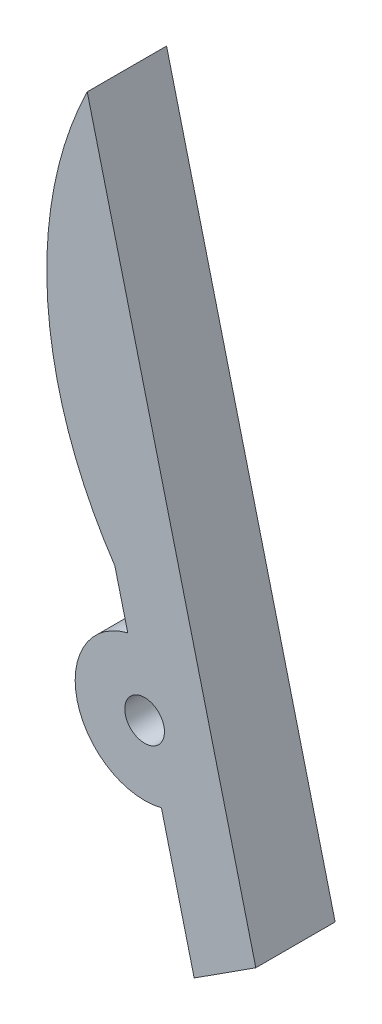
ISO-10303-21;
HEADER;
FILE_DESCRIPTION(('STEP AP214'),'2;1');
FILE_NAME('part.step','',(''),(''),'','','');
FILE_SCHEMA(('AUTOMOTIVE_DESIGN { 1 0 10303 214 1 1 1 1 }'));
ENDSEC;
DATA;
#1=APPLICATION_CONTEXT('core data for automotive mechanical design processes');
#2=APPLICATION_PROTOCOL_DEFINITION('international standard','automotive_design',2000,#1);
#3=PRODUCT_CONTEXT('',#1,'mechanical');
#4=PRODUCT('Part','Part','',(#3));
#5=PRODUCT_RELATED_PRODUCT_CATEGORY('part','',(#4));
#6=PRODUCT_DEFINITION_FORMATION('','',#4);
#7=PRODUCT_DEFINITION_CONTEXT('part definition',#1,'design');
#8=PRODUCT_DEFINITION('design','',#6,#7);
#9=PRODUCT_DEFINITION_SHAPE('','',#8);
#10=(LENGTH_UNIT() NAMED_UNIT(*) SI_UNIT(.MILLI.,.METRE.));
#11=(NAMED_UNIT(*) PLANE_ANGLE_UNIT() SI_UNIT($,.RADIAN.));
#12=(NAMED_UNIT(*) SI_UNIT($,.STERADIAN.) SOLID_ANGLE_UNIT());
#13=UNCERTAINTY_MEASURE_WITH_UNIT(LENGTH_MEASURE(1.E-05),#10,'distance_accuracy_value','');
#14=(GEOMETRIC_REPRESENTATION_CONTEXT(3) GLOBAL_UNCERTAINTY_ASSIGNED_CONTEXT((#13)) GLOBAL_UNIT_ASSIGNED_CONTEXT((#10,
#11,#12)) REPRESENTATION_CONTEXT('',''));
#15=CARTESIAN_POINT('',(0.,0.,0.));
#16=DIRECTION('',(0.,0.,1.));
#17=DIRECTION('',(1.,0.,0.));
#18=AXIS2_PLACEMENT_3D('',#15,#16,#17);
#19=CARTESIAN_POINT('',(4.5,33.,41.5109748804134));
#20=DIRECTION('',(0.970142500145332,0.242535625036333,0.));
#21=DIRECTION('',(-0.242535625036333,0.970142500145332,0.));
#22=AXIS2_PLACEMENT_3D('',#19,#20,#21);
#23=PLANE('',#22);
#24=DIRECTION('',(0.242535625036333,-0.970142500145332,0.));
#25=VECTOR('',#24,1.);
#26=CARTESIAN_POINT('',(4.5,33.,4.));
#27=LINE('',#26,#25);
#28=CARTESIAN_POINT('',(2.84887468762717,39.6045012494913,4.));
#29=VERTEX_POINT('',#28);
#30=CARTESIAN_POINT('',(4.5,33.,4.));
#31=VERTEX_POINT('',#30);
#32=EDGE_CURVE('E87',#29,#31,#27,.T.);
#33=ORIENTED_EDGE('',*,*,#32,.F.);
#34=DIRECTION('',(0.,0.,-1.));
#35=VECTOR('',#34,1.);
#36=CARTESIAN_POINT('',(2.84887468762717,39.6045012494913,41.5109748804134));
#37=LINE('',#36,#35);
#38=CARTESIAN_POINT('',(2.84887468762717,39.6045012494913,0.));
#39=VERTEX_POINT('',#38);
#40=EDGE_CURVE('E47',#29,#39,#37,.T.);
#41=ORIENTED_EDGE('',*,*,#40,.T.);
#42=DIRECTION('',(0.242535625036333,-0.970142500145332,0.));
#43=VECTOR('',#42,1.);
#44=CARTESIAN_POINT('',(4.5,33.,0.));
#45=LINE('',#44,#43);
#46=CARTESIAN_POINT('',(4.5,33.,0.));
#47=VERTEX_POINT('',#46);
#48=EDGE_CURVE('E90',#39,#47,#45,.T.);
#49=ORIENTED_EDGE('',*,*,#48,.T.);
#50=DIRECTION('',(0.,0.,-1.));
#51=VECTOR('',#50,1.);
#52=CARTESIAN_POINT('',(4.5,33.,41.5109748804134));
#53=LINE('',#52,#51);
#54=EDGE_CURVE('E84',#31,#47,#53,.T.);
#55=ORIENTED_EDGE('',*,*,#54,.F.);
#56=EDGE_LOOP('',(#33,#41,#49,#55));
#57=FACE_BOUND('',#56,.T.);
#58=ADVANCED_FACE('F31',(#57),#23,.F.);
#59=CARTESIAN_POINT('',(2.,43.,41.5109748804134));
#60=DIRECTION('',(0.,0.,-1.));
#61=DIRECTION('',(-1.,0.,0.));
#62=AXIS2_PLACEMENT_3D('',#59,#60,#61);
#63=CYLINDRICAL_SURFACE('',#62,3.5);
#64=CARTESIAN_POINT('',(2.,43.,4.));
#65=DIRECTION('',(0.,0.,1.));
#66=DIRECTION('',(1.,0.,0.));
#67=AXIS2_PLACEMENT_3D('',#64,#65,#66);
#68=CIRCLE('',#67,3.5);
#69=CARTESIAN_POINT('',(1.15112531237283,46.3954987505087,4.));
#70=VERTEX_POINT('',#69);
#71=EDGE_CURVE('E102',#70,#29,#68,.T.);
#72=ORIENTED_EDGE('',*,*,#71,.F.);
#73=DIRECTION('',(0.,0.,-1.));
#74=VECTOR('',#73,1.);
#75=CARTESIAN_POINT('',(1.15112531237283,46.3954987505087,41.5109748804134));
#76=LINE('',#75,#74);
#77=CARTESIAN_POINT('',(1.15112531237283,46.3954987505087,0.));
#78=VERTEX_POINT('',#77);
#79=EDGE_CURVE('E130',#70,#78,#76,.T.);
#80=ORIENTED_EDGE('',*,*,#79,.T.);
#81=CARTESIAN_POINT('',(2.,43.,0.));
#82=DIRECTION('',(0.,0.,1.));
#83=DIRECTION('',(1.,0.,0.));
#84=AXIS2_PLACEMENT_3D('',#81,#82,#83);
#85=CIRCLE('',#84,3.5);
#86=EDGE_CURVE('E126',#78,#39,#85,.T.);
#87=ORIENTED_EDGE('',*,*,#86,.T.);
#88=ORIENTED_EDGE('',*,*,#40,.F.);
#89=EDGE_LOOP('',(#72,#80,#87,#88));
#90=FACE_BOUND('',#89,.T.);
#91=ADVANCED_FACE('F148',(#90),#63,.T.);
#92=CARTESIAN_POINT('',(1.15112531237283,46.3954987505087,41.5109748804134));
#93=DIRECTION('',(0.970142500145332,0.242535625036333,0.));
#94=DIRECTION('',(-0.242535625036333,0.970142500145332,0.));
#95=AXIS2_PLACEMENT_3D('',#92,#93,#94);
#96=PLANE('',#95);
#97=DIRECTION('',(0.242535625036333,-0.970142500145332,0.));
#98=VECTOR('',#97,1.);
#99=CARTESIAN_POINT('',(1.15112531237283,46.3954987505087,4.));
#100=LINE('',#99,#98);
#101=CARTESIAN_POINT('',(0.499999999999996,49.,4.));
#102=VERTEX_POINT('',#101);
#103=EDGE_CURVE('E104',#102,#70,#100,.T.);
#104=ORIENTED_EDGE('',*,*,#103,.F.);
#105=DIRECTION('',(0.,0.,-1.));
#106=VECTOR('',#105,1.);
#107=CARTESIAN_POINT('',(0.499999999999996,49.,41.5109748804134));
#108=LINE('',#107,#106);
#109=CARTESIAN_POINT('',(0.499999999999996,49.,0.));
#110=VERTEX_POINT('',#109);
#111=EDGE_CURVE('E132',#102,#110,#108,.T.);
#112=ORIENTED_EDGE('',*,*,#111,.T.);
#113=DIRECTION('',(0.242535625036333,-0.970142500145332,0.));
#114=VECTOR('',#113,1.);
#115=CARTESIAN_POINT('',(1.15112531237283,46.3954987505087,0.));
#116=LINE('',#115,#114);
#117=EDGE_CURVE('E123',#110,#78,#116,.T.);
#118=ORIENTED_EDGE('',*,*,#117,.T.);
#119=ORIENTED_EDGE('',*,*,#79,.F.);
#120=EDGE_LOOP('',(#104,#112,#118,#119));
#121=FACE_BOUND('',#120,.T.);
#122=ADVANCED_FACE('F147',(#121),#96,.F.);
#123=CARTESIAN_POINT('',(17.0685885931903,60.2018691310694,41.5109748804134));
#124=DIRECTION('',(0.,0.,-1.));
#125=DIRECTION('',(-1.,0.,0.));
#126=AXIS2_PLACEMENT_3D('',#123,#124,#125);
#127=CYLINDRICAL_SURFACE('',#126,20.);
#128=CARTESIAN_POINT('',(17.0685885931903,60.2018691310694,4.));
#129=DIRECTION('',(0.,0.,1.));
#130=DIRECTION('',(1.,0.,0.));
#131=AXIS2_PLACEMENT_3D('',#128,#129,#130);
#132=CIRCLE('',#131,20.);
#133=CARTESIAN_POINT('',(-0.892282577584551,69.,4.));
#134=VERTEX_POINT('',#133);
#135=EDGE_CURVE('E109',#134,#102,#132,.T.);
#136=ORIENTED_EDGE('',*,*,#135,.F.);
#137=DIRECTION('',(0.,0.,-1.));
#138=VECTOR('',#137,1.);
#139=CARTESIAN_POINT('',(-0.892282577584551,69.,41.5109748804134));
#140=LINE('',#139,#138);
#141=CARTESIAN_POINT('',(-0.892282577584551,69.,0.));
#142=VERTEX_POINT('',#141);
#143=EDGE_CURVE('E40',#134,#142,#140,.T.);
#144=ORIENTED_EDGE('',*,*,#143,.T.);
#145=CARTESIAN_POINT('',(17.0685885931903,60.2018691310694,0.));
#146=DIRECTION('',(0.,0.,1.));
#147=DIRECTION('',(-1.,0.,0.));
#148=AXIS2_PLACEMENT_3D('',#145,#146,#147);
#149=CIRCLE('',#148,20.);
#150=EDGE_CURVE('E120',#142,#110,#149,.T.);
#151=ORIENTED_EDGE('',*,*,#150,.T.);
#152=ORIENTED_EDGE('',*,*,#111,.F.);
#153=EDGE_LOOP('',(#136,#144,#151,#152));
#154=FACE_BOUND('',#153,.T.);
#155=ADVANCED_FACE('F135',(#154),#127,.T.);
#156=CARTESIAN_POINT('',(-0.892282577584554,69.,41.5109748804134));
#157=DIRECTION('',(-0.970142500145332,-0.242535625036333,0.));
#158=DIRECTION('',(0.242535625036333,-0.970142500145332,0.));
#159=AXIS2_PLACEMENT_3D('',#156,#157,#158);
#160=PLANE('',#159);
#161=DIRECTION('',(-0.242535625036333,0.970142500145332,0.));
#162=VECTOR('',#161,1.);
#163=CARTESIAN_POINT('',(-0.892282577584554,69.,4.));
#164=LINE('',#163,#162);
#165=CARTESIAN_POINT('',(7.60771742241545,35.,4.));
#166=VERTEX_POINT('',#165);
#167=EDGE_CURVE('E54',#166,#134,#164,.T.);
#168=ORIENTED_EDGE('',*,*,#167,.F.);
#169=DIRECTION('',(0.,0.,-1.));
#170=VECTOR('',#169,1.);
#171=CARTESIAN_POINT('',(7.60771742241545,35.,41.5109748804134));
#172=LINE('',#171,#170);
#173=CARTESIAN_POINT('',(7.60771742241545,35.,0.));
#174=VERTEX_POINT('',#173);
#175=EDGE_CURVE('E11',#166,#174,#172,.T.);
#176=ORIENTED_EDGE('',*,*,#175,.T.);
#177=DIRECTION('',(-0.242535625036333,0.970142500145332,0.));
#178=VECTOR('',#177,1.);
#179=CARTESIAN_POINT('',(-0.892282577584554,69.,0.));
#180=LINE('',#179,#178);
#181=EDGE_CURVE('E117',#174,#142,#180,.T.);
#182=ORIENTED_EDGE('',*,*,#181,.T.);
#183=ORIENTED_EDGE('',*,*,#143,.F.);
#184=EDGE_LOOP('',(#168,#176,#182,#183));
#185=FACE_BOUND('',#184,.T.);
#186=ADVANCED_FACE('F140',(#185),#160,.F.);
#187=CARTESIAN_POINT('',(7.60771742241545,35.,41.5109748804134));
#188=DIRECTION('',(-0.541175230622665,0.840909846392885,0.));
#189=DIRECTION('',(-0.840909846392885,-0.541175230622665,0.));
#190=AXIS2_PLACEMENT_3D('',#187,#188,#189);
#191=PLANE('',#190);
#192=DIRECTION('',(0.840909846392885,0.541175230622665,0.));
#193=VECTOR('',#192,1.);
#194=CARTESIAN_POINT('',(7.60771742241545,35.,4.));
#195=LINE('',#194,#193);
#196=EDGE_CURVE('E96',#31,#166,#195,.T.);
#197=ORIENTED_EDGE('',*,*,#196,.F.);
#198=ORIENTED_EDGE('',*,*,#54,.T.);
#199=DIRECTION('',(0.840909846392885,0.541175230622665,0.));
#200=VECTOR('',#199,1.);
#201=CARTESIAN_POINT('',(7.60771742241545,35.,0.));
#202=LINE('',#201,#200);
#203=EDGE_CURVE('E115',#47,#174,#202,.T.);
#204=ORIENTED_EDGE('',*,*,#203,.T.);
#205=ORIENTED_EDGE('',*,*,#175,.F.);
#206=EDGE_LOOP('',(#197,#198,#204,#205));
#207=FACE_BOUND('',#206,.T.);
#208=ADVANCED_FACE('F33',(#207),#191,.F.);
#209=CARTESIAN_POINT('',(2.,43.,0.));
#210=DIRECTION('',(0.,0.,1.));
#211=DIRECTION('',(1.,0.,0.));
#212=AXIS2_PLACEMENT_3D('',#209,#210,#211);
#213=PLANE('',#212);
#214=ORIENTED_EDGE('',*,*,#203,.F.);
#215=ORIENTED_EDGE('',*,*,#48,.F.);
#216=ORIENTED_EDGE('',*,*,#86,.F.);
#217=ORIENTED_EDGE('',*,*,#117,.F.);
#218=ORIENTED_EDGE('',*,*,#150,.F.);
#219=ORIENTED_EDGE('',*,*,#181,.F.);
#220=EDGE_LOOP('',(#214,#215,#216,#217,#218,#219));
#221=FACE_BOUND('',#220,.T.);
#222=CARTESIAN_POINT('',(2.,43.,0.));
#223=DIRECTION('',(0.,0.,1.));
#224=DIRECTION('',(1.,0.,0.));
#225=AXIS2_PLACEMENT_3D('',#222,#223,#224);
#226=CIRCLE('',#225,1.);
#227=CARTESIAN_POINT('',(3.,43.,0.));
#228=VERTEX_POINT('',#227);
#229=EDGE_CURVE('E98',#228,#228,#226,.T.);
#230=ORIENTED_EDGE('',*,*,#229,.T.);
#231=EDGE_LOOP('',(#230));
#232=FACE_BOUND('',#231,.T.);
#233=ADVANCED_FACE('F142',(#221,#232),#213,.F.);
#234=CARTESIAN_POINT('',(2.,43.,41.5109748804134));
#235=DIRECTION('',(0.,0.,-1.));
#236=DIRECTION('',(-1.,0.,0.));
#237=AXIS2_PLACEMENT_3D('',#234,#235,#236);
#238=CYLINDRICAL_SURFACE('',#237,1.);
#239=ORIENTED_EDGE('',*,*,#229,.F.);
#240=EDGE_LOOP('',(#239));
#241=FACE_BOUND('',#240,.T.);
#242=CARTESIAN_POINT('',(2.,43.,4.));
#243=DIRECTION('',(0.,0.,1.));
#244=DIRECTION('',(1.,0.,0.));
#245=AXIS2_PLACEMENT_3D('',#242,#243,#244);
#246=CIRCLE('',#245,1.);
#247=CARTESIAN_POINT('',(3.,43.,4.));
#248=VERTEX_POINT('',#247);
#249=EDGE_CURVE('E35',#248,#248,#246,.T.);
#250=ORIENTED_EDGE('',*,*,#249,.T.);
#251=EDGE_LOOP('',(#250));
#252=FACE_BOUND('',#251,.T.);
#253=ADVANCED_FACE('F167',(#241,#252),#238,.F.);
#254=CARTESIAN_POINT('',(-1.,30.5,4.));
#255=DIRECTION('',(0.,0.,1.));
#256=DIRECTION('',(1.,0.,0.));
#257=AXIS2_PLACEMENT_3D('',#254,#255,#256);
#258=PLANE('',#257);
#259=ORIENTED_EDGE('',*,*,#249,.F.);
#260=EDGE_LOOP('',(#259));
#261=FACE_BOUND('',#260,.T.);
#262=ORIENTED_EDGE('',*,*,#32,.T.);
#263=ORIENTED_EDGE('',*,*,#196,.T.);
#264=ORIENTED_EDGE('',*,*,#167,.T.);
#265=ORIENTED_EDGE('',*,*,#135,.T.);
#266=ORIENTED_EDGE('',*,*,#103,.T.);
#267=ORIENTED_EDGE('',*,*,#71,.T.);
#268=EDGE_LOOP('',(#262,#263,#264,#265,#266,#267));
#269=FACE_BOUND('',#268,.T.);
#270=ADVANCED_FACE('F100',(#261,#269),#258,.T.);
#271=CLOSED_SHELL('',(#58,#91,#122,#155,#186,#208,#233,#253,#270));
#272=MANIFOLD_SOLID_BREP('B2',#271);
#273=ADVANCED_BREP_SHAPE_REPRESENTATION('',(#18,#272),#14);
#274=SHAPE_DEFINITION_REPRESENTATION(#9,#273);
ENDSEC;
END-ISO-10303-21;
